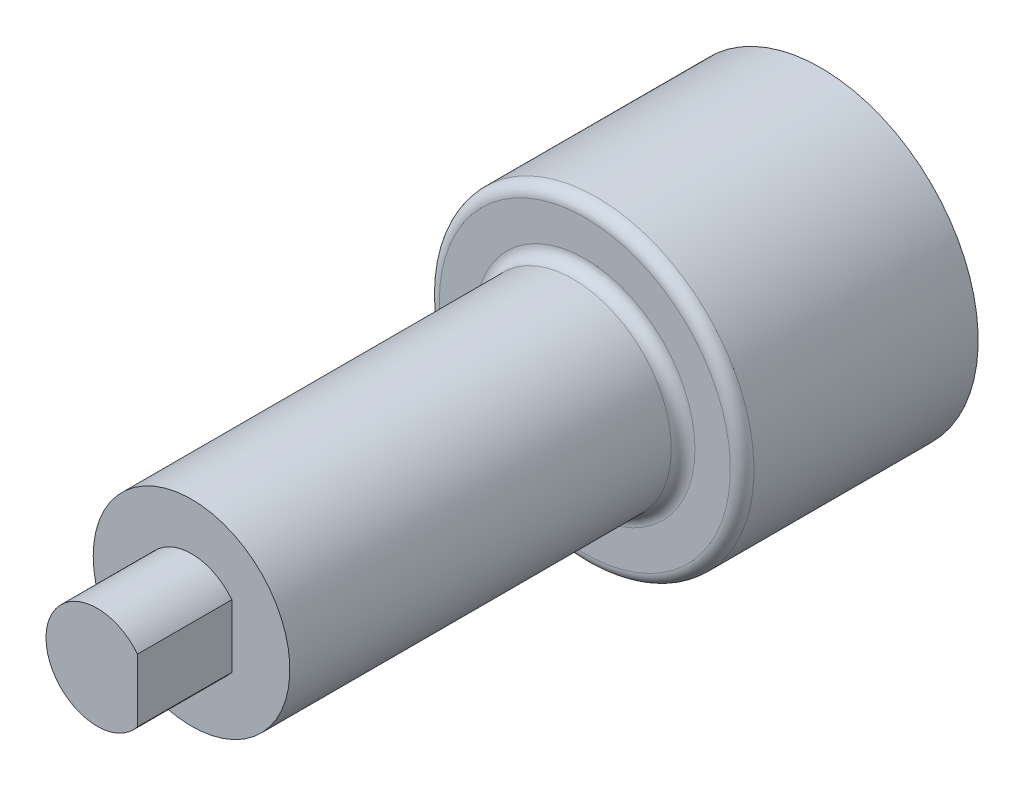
ISO-10303-21;
HEADER;
FILE_DESCRIPTION(('STEP AP214'),'2;1');
FILE_NAME('part.step','',(''),(''),'','','');
FILE_SCHEMA(('AUTOMOTIVE_DESIGN { 1 0 10303 214 1 1 1 1 }'));
ENDSEC;
DATA;
#1=APPLICATION_CONTEXT('core data for automotive mechanical design processes');
#2=APPLICATION_PROTOCOL_DEFINITION('international standard','automotive_design',2000,#1);
#3=PRODUCT_CONTEXT('',#1,'mechanical');
#4=PRODUCT('Part','Part','',(#3));
#5=PRODUCT_RELATED_PRODUCT_CATEGORY('part','',(#4));
#6=PRODUCT_DEFINITION_FORMATION('','',#4);
#7=PRODUCT_DEFINITION_CONTEXT('part definition',#1,'design');
#8=PRODUCT_DEFINITION('design','',#6,#7);
#9=PRODUCT_DEFINITION_SHAPE('','',#8);
#10=(LENGTH_UNIT() NAMED_UNIT(*) SI_UNIT(.MILLI.,.METRE.));
#11=(NAMED_UNIT(*) PLANE_ANGLE_UNIT() SI_UNIT($,.RADIAN.));
#12=(NAMED_UNIT(*) SI_UNIT($,.STERADIAN.) SOLID_ANGLE_UNIT());
#13=UNCERTAINTY_MEASURE_WITH_UNIT(LENGTH_MEASURE(1.E-05),#10,'distance_accuracy_value','');
#14=(GEOMETRIC_REPRESENTATION_CONTEXT(3) GLOBAL_UNCERTAINTY_ASSIGNED_CONTEXT((#13)) GLOBAL_UNIT_ASSIGNED_CONTEXT((#10,
#11,#12)) REPRESENTATION_CONTEXT('',''));
#15=CARTESIAN_POINT('',(0.,0.,0.));
#16=DIRECTION('',(0.,0.,1.));
#17=DIRECTION('',(1.,0.,0.));
#18=AXIS2_PLACEMENT_3D('',#15,#16,#17);
#19=CARTESIAN_POINT('',(0.,0.,-12.));
#20=DIRECTION('',(0.,0.,1.));
#21=DIRECTION('',(1.,0.,0.));
#22=AXIS2_PLACEMENT_3D('',#19,#20,#21);
#23=CYLINDRICAL_SURFACE('',#22,6.5);
#24=CARTESIAN_POINT('',(0.,0.,0.));
#25=DIRECTION('',(0.,0.,1.));
#26=DIRECTION('',(1.,0.,0.));
#27=AXIS2_PLACEMENT_3D('',#24,#25,#26);
#28=CIRCLE('',#27,6.5);
#29=CARTESIAN_POINT('',(5.1234753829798,4.,0.));
#30=VERTEX_POINT('',#29);
#31=CARTESIAN_POINT('',(5.1234753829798,-4.,0.));
#32=VERTEX_POINT('',#31);
#33=EDGE_CURVE('E71',#30,#32,#28,.T.);
#34=ORIENTED_EDGE('',*,*,#33,.F.);
#35=DIRECTION('',(0.,0.,1.));
#36=VECTOR('',#35,1.);
#37=CARTESIAN_POINT('',(5.1234753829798,4.,-12.));
#38=LINE('',#37,#36);
#39=CARTESIAN_POINT('',(5.1234753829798,4.,-12.));
#40=VERTEX_POINT('',#39);
#41=EDGE_CURVE('E52',#40,#30,#38,.T.);
#42=ORIENTED_EDGE('',*,*,#41,.F.);
#43=CARTESIAN_POINT('',(0.,0.,-12.));
#44=DIRECTION('',(0.,0.,1.));
#45=DIRECTION('',(1.,0.,0.));
#46=AXIS2_PLACEMENT_3D('',#43,#44,#45);
#47=CIRCLE('',#46,6.5);
#48=CARTESIAN_POINT('',(5.1234753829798,-4.,-12.));
#49=VERTEX_POINT('',#48);
#50=EDGE_CURVE('E45',#40,#49,#47,.T.);
#51=ORIENTED_EDGE('',*,*,#50,.T.);
#52=DIRECTION('',(0.,0.,1.));
#53=VECTOR('',#52,1.);
#54=CARTESIAN_POINT('',(5.1234753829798,-4.,-12.));
#55=LINE('',#54,#53);
#56=EDGE_CURVE('E62',#49,#32,#55,.T.);
#57=ORIENTED_EDGE('',*,*,#56,.T.);
#58=EDGE_LOOP('',(#34,#42,#51,#57));
#59=FACE_BOUND('',#58,.T.);
#60=ADVANCED_FACE('F32',(#59),#23,.T.);
#61=CARTESIAN_POINT('',(5.1234753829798,-4.,-12.));
#62=DIRECTION('',(1.,0.,0.));
#63=DIRECTION('',(0.,0.,-1.));
#64=AXIS2_PLACEMENT_3D('',#61,#62,#63);
#65=PLANE('',#64);
#66=DIRECTION('',(0.,1.,0.));
#67=VECTOR('',#66,1.);
#68=CARTESIAN_POINT('',(5.1234753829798,-4.,0.));
#69=LINE('',#68,#67);
#70=EDGE_CURVE('E66',#32,#30,#69,.T.);
#71=ORIENTED_EDGE('',*,*,#70,.F.);
#72=ORIENTED_EDGE('',*,*,#56,.F.);
#73=DIRECTION('',(0.,1.,0.));
#74=VECTOR('',#73,1.);
#75=CARTESIAN_POINT('',(5.1234753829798,-4.,-12.));
#76=LINE('',#75,#74);
#77=EDGE_CURVE('E58',#49,#40,#76,.T.);
#78=ORIENTED_EDGE('',*,*,#77,.T.);
#79=ORIENTED_EDGE('',*,*,#41,.T.);
#80=EDGE_LOOP('',(#71,#72,#78,#79));
#81=FACE_BOUND('',#80,.T.);
#82=ADVANCED_FACE('F64',(#81),#65,.T.);
#83=CARTESIAN_POINT('',(0.,0.,0.));
#84=DIRECTION('',(0.,0.,1.));
#85=DIRECTION('',(1.,0.,0.));
#86=AXIS2_PLACEMENT_3D('',#83,#84,#85);
#87=PLANE('',#86);
#88=ORIENTED_EDGE('',*,*,#33,.T.);
#89=ORIENTED_EDGE('',*,*,#70,.T.);
#90=EDGE_LOOP('',(#88,#89));
#91=FACE_BOUND('',#90,.T.);
#92=ADVANCED_FACE('F119',(#91),#87,.T.);
#93=CARTESIAN_POINT('',(0.,0.,-62.));
#94=DIRECTION('',(0.,0.,1.));
#95=DIRECTION('',(1.,0.,0.));
#96=AXIS2_PLACEMENT_3D('',#93,#94,#95);
#97=CYLINDRICAL_SURFACE('',#96,12.5);
#98=CARTESIAN_POINT('',(0.,0.,-60.5));
#99=DIRECTION('',(0.,0.,-1.));
#100=DIRECTION('',(-1.,0.,0.));
#101=AXIS2_PLACEMENT_3D('',#98,#99,#100);
#102=CIRCLE('',#101,12.5);
#103=CARTESIAN_POINT('',(-12.5,0.,-60.5));
#104=VERTEX_POINT('',#103);
#105=EDGE_CURVE('E39',#104,#104,#102,.F.);
#106=ORIENTED_EDGE('',*,*,#105,.T.);
#107=EDGE_LOOP('',(#106));
#108=FACE_BOUND('',#107,.T.);
#109=CARTESIAN_POINT('',(0.,0.,-12.));
#110=DIRECTION('',(0.,0.,-1.));
#111=DIRECTION('',(-1.,0.,0.));
#112=AXIS2_PLACEMENT_3D('',#109,#110,#111);
#113=CIRCLE('',#112,12.5);
#114=CARTESIAN_POINT('',(-12.5,0.,-12.));
#115=VERTEX_POINT('',#114);
#116=EDGE_CURVE('E114',#115,#115,#113,.T.);
#117=ORIENTED_EDGE('',*,*,#116,.T.);
#118=EDGE_LOOP('',(#117));
#119=FACE_BOUND('',#118,.T.);
#120=ADVANCED_FACE('F84',(#108,#119),#97,.T.);
#121=CARTESIAN_POINT('',(0.,0.,-12.));
#122=DIRECTION('',(0.,0.,-1.));
#123=DIRECTION('',(-1.,0.,0.));
#124=AXIS2_PLACEMENT_3D('',#121,#122,#123);
#125=PLANE('',#124);
#126=ORIENTED_EDGE('',*,*,#50,.F.);
#127=ORIENTED_EDGE('',*,*,#77,.F.);
#128=EDGE_LOOP('',(#126,#127));
#129=FACE_BOUND('',#128,.T.);
#130=ORIENTED_EDGE('',*,*,#116,.F.);
#131=EDGE_LOOP('',(#130));
#132=FACE_BOUND('',#131,.T.);
#133=ADVANCED_FACE('F60',(#129,#132),#125,.F.);
#134=CARTESIAN_POINT('',(0.,0.,-62.));
#135=DIRECTION('',(0.,0.,-1.));
#136=DIRECTION('',(-1.,0.,0.));
#137=AXIS2_PLACEMENT_3D('',#134,#135,#136);
#138=PLANE('',#137);
#139=CARTESIAN_POINT('',(0.,0.,-62.));
#140=DIRECTION('',(0.,0.,-1.));
#141=DIRECTION('',(-1.,0.,0.));
#142=AXIS2_PLACEMENT_3D('',#139,#140,#141);
#143=CIRCLE('',#142,14.);
#144=CARTESIAN_POINT('',(-14.,0.,-62.));
#145=VERTEX_POINT('',#144);
#146=EDGE_CURVE('E79',#145,#145,#143,.T.);
#147=ORIENTED_EDGE('',*,*,#146,.T.);
#148=EDGE_LOOP('',(#147));
#149=FACE_BOUND('',#148,.T.);
#150=CARTESIAN_POINT('',(0.,0.,-62.));
#151=DIRECTION('',(0.,0.,-1.));
#152=DIRECTION('',(-1.,0.,0.));
#153=AXIS2_PLACEMENT_3D('',#150,#151,#152);
#154=CIRCLE('',#153,18.5);
#155=CARTESIAN_POINT('',(-18.5,0.,-62.));
#156=VERTEX_POINT('',#155);
#157=EDGE_CURVE('E75',#156,#156,#154,.F.);
#158=ORIENTED_EDGE('',*,*,#157,.T.);
#159=EDGE_LOOP('',(#158));
#160=FACE_BOUND('',#159,.T.);
#161=ADVANCED_FACE('F95',(#149,#160),#138,.F.);
#162=CARTESIAN_POINT('',(0.,0.,-92.));
#163=DIRECTION('',(0.,0.,1.));
#164=DIRECTION('',(1.,0.,0.));
#165=AXIS2_PLACEMENT_3D('',#162,#163,#164);
#166=CYLINDRICAL_SURFACE('',#165,20.);
#167=CARTESIAN_POINT('',(0.,0.,-63.5));
#168=DIRECTION('',(0.,0.,-1.));
#169=DIRECTION('',(-1.,0.,0.));
#170=AXIS2_PLACEMENT_3D('',#167,#168,#169);
#171=CIRCLE('',#170,20.);
#172=CARTESIAN_POINT('',(-20.,0.,-63.5));
#173=VERTEX_POINT('',#172);
#174=EDGE_CURVE('E11',#173,#173,#171,.T.);
#175=ORIENTED_EDGE('',*,*,#174,.T.);
#176=EDGE_LOOP('',(#175));
#177=FACE_BOUND('',#176,.T.);
#178=CARTESIAN_POINT('',(0.,0.,-92.));
#179=DIRECTION('',(0.,0.,-1.));
#180=DIRECTION('',(-1.,0.,0.));
#181=AXIS2_PLACEMENT_3D('',#178,#179,#180);
#182=CIRCLE('',#181,20.);
#183=CARTESIAN_POINT('',(-20.,0.,-92.));
#184=VERTEX_POINT('',#183);
#185=EDGE_CURVE('E112',#184,#184,#182,.T.);
#186=ORIENTED_EDGE('',*,*,#185,.F.);
#187=EDGE_LOOP('',(#186));
#188=FACE_BOUND('',#187,.T.);
#189=ADVANCED_FACE('F98',(#177,#188),#166,.T.);
#190=CARTESIAN_POINT('',(0.,0.,-92.));
#191=DIRECTION('',(0.,0.,-1.));
#192=DIRECTION('',(-1.,0.,0.));
#193=AXIS2_PLACEMENT_3D('',#190,#191,#192);
#194=PLANE('',#193);
#195=ORIENTED_EDGE('',*,*,#185,.T.);
#196=EDGE_LOOP('',(#195));
#197=FACE_BOUND('',#196,.T.);
#198=ADVANCED_FACE('F91',(#197),#194,.T.);
#199=CARTESIAN_POINT('',(0.,0.,-60.5));
#200=DIRECTION('',(0.,0.,-1.));
#201=DIRECTION('',(-1.,0.,0.));
#202=AXIS2_PLACEMENT_3D('',#199,#200,#201);
#203=TOROIDAL_SURFACE('',#202,14.,1.5);
#204=ORIENTED_EDGE('',*,*,#105,.F.);
#205=EDGE_LOOP('',(#204));
#206=FACE_BOUND('',#205,.T.);
#207=ORIENTED_EDGE('',*,*,#146,.F.);
#208=EDGE_LOOP('',(#207));
#209=FACE_BOUND('',#208,.T.);
#210=ADVANCED_FACE('F87',(#206,#209),#203,.F.);
#211=CARTESIAN_POINT('',(0.,0.,-63.5));
#212=DIRECTION('',(0.,0.,-1.));
#213=DIRECTION('',(-1.,0.,0.));
#214=AXIS2_PLACEMENT_3D('',#211,#212,#213);
#215=TOROIDAL_SURFACE('',#214,18.5,1.5);
#216=ORIENTED_EDGE('',*,*,#157,.F.);
#217=EDGE_LOOP('',(#216));
#218=FACE_BOUND('',#217,.T.);
#219=ORIENTED_EDGE('',*,*,#174,.F.);
#220=EDGE_LOOP('',(#219));
#221=FACE_BOUND('',#220,.T.);
#222=ADVANCED_FACE('F90',(#218,#221),#215,.T.);
#223=CLOSED_SHELL('',(#60,#82,#92,#120,#133,#161,#189,#198,#210,#222));
#224=MANIFOLD_SOLID_BREP('B2',#223);
#225=ADVANCED_BREP_SHAPE_REPRESENTATION('',(#18,#224),#14);
#226=SHAPE_DEFINITION_REPRESENTATION(#9,#225);
ENDSEC;
END-ISO-10303-21;
